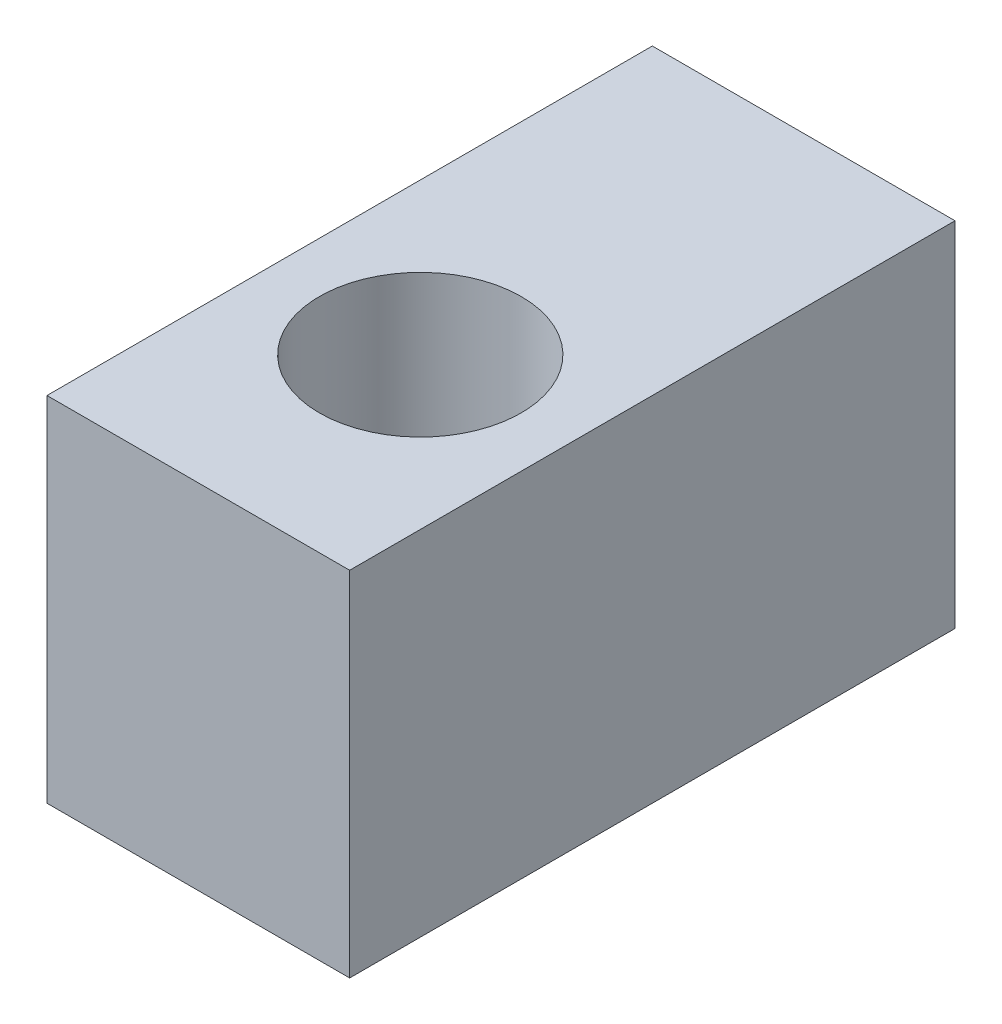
ISO-10303-21;
HEADER;
FILE_DESCRIPTION(('STEP AP214'),'2;1');
FILE_NAME('part.step','',(''),(''),'','','');
FILE_SCHEMA(('AUTOMOTIVE_DESIGN { 1 0 10303 214 1 1 1 1 }'));
ENDSEC;
DATA;
#1=APPLICATION_CONTEXT('core data for automotive mechanical design processes');
#2=APPLICATION_PROTOCOL_DEFINITION('international standard','automotive_design',2000,#1);
#3=PRODUCT_CONTEXT('',#1,'mechanical');
#4=PRODUCT('Part','Part','',(#3));
#5=PRODUCT_RELATED_PRODUCT_CATEGORY('part','',(#4));
#6=PRODUCT_DEFINITION_FORMATION('','',#4);
#7=PRODUCT_DEFINITION_CONTEXT('part definition',#1,'design');
#8=PRODUCT_DEFINITION('design','',#6,#7);
#9=PRODUCT_DEFINITION_SHAPE('','',#8);
#10=(LENGTH_UNIT() NAMED_UNIT(*) SI_UNIT(.MILLI.,.METRE.));
#11=(NAMED_UNIT(*) PLANE_ANGLE_UNIT() SI_UNIT($,.RADIAN.));
#12=(NAMED_UNIT(*) SI_UNIT($,.STERADIAN.) SOLID_ANGLE_UNIT());
#13=UNCERTAINTY_MEASURE_WITH_UNIT(LENGTH_MEASURE(1.E-05),#10,'distance_accuracy_value','');
#14=(GEOMETRIC_REPRESENTATION_CONTEXT(3) GLOBAL_UNCERTAINTY_ASSIGNED_CONTEXT((#13)) GLOBAL_UNIT_ASSIGNED_CONTEXT((#10,
#11,#12)) REPRESENTATION_CONTEXT('',''));
#15=CARTESIAN_POINT('',(0.,0.,0.));
#16=DIRECTION('',(0.,0.,1.));
#17=DIRECTION('',(1.,0.,0.));
#18=AXIS2_PLACEMENT_3D('',#15,#16,#17);
#19=CARTESIAN_POINT('',(0.,0.,60.));
#20=DIRECTION('',(1.,0.,0.));
#21=DIRECTION('',(0.,0.,-1.));
#22=AXIS2_PLACEMENT_3D('',#19,#20,#21);
#23=PLANE('',#22);
#24=DIRECTION('',(0.,-1.,0.));
#25=VECTOR('',#24,1.);
#26=CARTESIAN_POINT('',(0.,0.,0.));
#27=LINE('',#26,#25);
#28=CARTESIAN_POINT('',(0.,0.,0.));
#29=VERTEX_POINT('',#28);
#30=CARTESIAN_POINT('',(0.,-35.,0.));
#31=VERTEX_POINT('',#30);
#32=EDGE_CURVE('E107',#29,#31,#27,.T.);
#33=ORIENTED_EDGE('',*,*,#32,.T.);
#34=DIRECTION('',(0.,0.,-1.));
#35=VECTOR('',#34,1.);
#36=CARTESIAN_POINT('',(0.,-35.,60.));
#37=LINE('',#36,#35);
#38=CARTESIAN_POINT('',(0.,-35.,60.));
#39=VERTEX_POINT('',#38);
#40=EDGE_CURVE('E11',#39,#31,#37,.T.);
#41=ORIENTED_EDGE('',*,*,#40,.F.);
#42=DIRECTION('',(0.,-1.,0.));
#43=VECTOR('',#42,1.);
#44=CARTESIAN_POINT('',(0.,0.,60.));
#45=LINE('',#44,#43);
#46=CARTESIAN_POINT('',(0.,0.,60.));
#47=VERTEX_POINT('',#46);
#48=EDGE_CURVE('E91',#47,#39,#45,.T.);
#49=ORIENTED_EDGE('',*,*,#48,.F.);
#50=DIRECTION('',(0.,0.,-1.));
#51=VECTOR('',#50,1.);
#52=CARTESIAN_POINT('',(0.,0.,60.));
#53=LINE('',#52,#51);
#54=EDGE_CURVE('E103',#47,#29,#53,.T.);
#55=ORIENTED_EDGE('',*,*,#54,.T.);
#56=EDGE_LOOP('',(#33,#41,#49,#55));
#57=FACE_BOUND('',#56,.T.);
#58=ADVANCED_FACE('F39',(#57),#23,.F.);
#59=CARTESIAN_POINT('',(0.,-35.,60.));
#60=DIRECTION('',(0.,1.,0.));
#61=DIRECTION('',(0.,0.,1.));
#62=AXIS2_PLACEMENT_3D('',#59,#60,#61);
#63=PLANE('',#62);
#64=DIRECTION('',(1.,0.,0.));
#65=VECTOR('',#64,1.);
#66=CARTESIAN_POINT('',(0.,-35.,0.));
#67=LINE('',#66,#65);
#68=CARTESIAN_POINT('',(30.,-35.,0.));
#69=VERTEX_POINT('',#68);
#70=EDGE_CURVE('E96',#31,#69,#67,.T.);
#71=ORIENTED_EDGE('',*,*,#70,.T.);
#72=DIRECTION('',(0.,0.,-1.));
#73=VECTOR('',#72,1.);
#74=CARTESIAN_POINT('',(30.,-35.,60.));
#75=LINE('',#74,#73);
#76=CARTESIAN_POINT('',(30.,-35.,60.));
#77=VERTEX_POINT('',#76);
#78=EDGE_CURVE('E48',#77,#69,#75,.T.);
#79=ORIENTED_EDGE('',*,*,#78,.F.);
#80=DIRECTION('',(1.,0.,0.));
#81=VECTOR('',#80,1.);
#82=CARTESIAN_POINT('',(0.,-35.,60.));
#83=LINE('',#82,#81);
#84=EDGE_CURVE('E86',#39,#77,#83,.T.);
#85=ORIENTED_EDGE('',*,*,#84,.F.);
#86=ORIENTED_EDGE('',*,*,#40,.T.);
#87=EDGE_LOOP('',(#71,#79,#85,#86));
#88=FACE_BOUND('',#87,.T.);
#89=ADVANCED_FACE('F95',(#88),#63,.F.);
#90=CARTESIAN_POINT('',(30.,0.,60.));
#91=DIRECTION('',(-1.,0.,0.));
#92=DIRECTION('',(0.,-1.,0.));
#93=AXIS2_PLACEMENT_3D('',#90,#91,#92);
#94=PLANE('',#93);
#95=DIRECTION('',(0.,1.,0.));
#96=VECTOR('',#95,1.);
#97=CARTESIAN_POINT('',(30.,0.,0.));
#98=LINE('',#97,#96);
#99=CARTESIAN_POINT('',(30.,0.,0.));
#100=VERTEX_POINT('',#99);
#101=EDGE_CURVE('E73',#69,#100,#98,.T.);
#102=ORIENTED_EDGE('',*,*,#101,.T.);
#103=DIRECTION('',(0.,0.,-1.));
#104=VECTOR('',#103,1.);
#105=CARTESIAN_POINT('',(30.,0.,60.));
#106=LINE('',#105,#104);
#107=CARTESIAN_POINT('',(30.,0.,60.));
#108=VERTEX_POINT('',#107);
#109=EDGE_CURVE('E98',#108,#100,#106,.T.);
#110=ORIENTED_EDGE('',*,*,#109,.F.);
#111=DIRECTION('',(0.,1.,0.));
#112=VECTOR('',#111,1.);
#113=CARTESIAN_POINT('',(30.,0.,60.));
#114=LINE('',#113,#112);
#115=EDGE_CURVE('E89',#77,#108,#114,.T.);
#116=ORIENTED_EDGE('',*,*,#115,.F.);
#117=ORIENTED_EDGE('',*,*,#78,.T.);
#118=EDGE_LOOP('',(#102,#110,#116,#117));
#119=FACE_BOUND('',#118,.T.);
#120=ADVANCED_FACE('F99',(#119),#94,.F.);
#121=CARTESIAN_POINT('',(0.,0.,60.));
#122=DIRECTION('',(0.,-1.,0.));
#123=DIRECTION('',(0.,0.,-1.));
#124=AXIS2_PLACEMENT_3D('',#121,#122,#123);
#125=PLANE('',#124);
#126=CARTESIAN_POINT('',(15.,0.,38.));
#127=DIRECTION('',(0.,1.,0.));
#128=DIRECTION('',(0.,0.,1.));
#129=AXIS2_PLACEMENT_3D('',#126,#127,#128);
#130=CIRCLE('',#129,10.);
#131=CARTESIAN_POINT('',(15.,0.,48.));
#132=VERTEX_POINT('',#131);
#133=EDGE_CURVE('E128',#132,#132,#130,.T.);
#134=ORIENTED_EDGE('',*,*,#133,.F.);
#135=EDGE_LOOP('',(#134));
#136=FACE_BOUND('',#135,.T.);
#137=DIRECTION('',(-1.,0.,0.));
#138=VECTOR('',#137,1.);
#139=CARTESIAN_POINT('',(0.,0.,0.));
#140=LINE('',#139,#138);
#141=EDGE_CURVE('E79',#100,#29,#140,.T.);
#142=ORIENTED_EDGE('',*,*,#141,.T.);
#143=ORIENTED_EDGE('',*,*,#54,.F.);
#144=DIRECTION('',(-1.,0.,0.));
#145=VECTOR('',#144,1.);
#146=CARTESIAN_POINT('',(0.,0.,60.));
#147=LINE('',#146,#145);
#148=EDGE_CURVE('E56',#108,#47,#147,.T.);
#149=ORIENTED_EDGE('',*,*,#148,.F.);
#150=ORIENTED_EDGE('',*,*,#109,.T.);
#151=EDGE_LOOP('',(#142,#143,#149,#150));
#152=FACE_BOUND('',#151,.T.);
#153=ADVANCED_FACE('F121',(#136,#152),#125,.F.);
#154=CARTESIAN_POINT('',(0.,0.,60.));
#155=DIRECTION('',(0.,0.,1.));
#156=DIRECTION('',(1.,0.,0.));
#157=AXIS2_PLACEMENT_3D('',#154,#155,#156);
#158=PLANE('',#157);
#159=ORIENTED_EDGE('',*,*,#48,.T.);
#160=ORIENTED_EDGE('',*,*,#84,.T.);
#161=ORIENTED_EDGE('',*,*,#115,.T.);
#162=ORIENTED_EDGE('',*,*,#148,.T.);
#163=EDGE_LOOP('',(#159,#160,#161,#162));
#164=FACE_BOUND('',#163,.T.);
#165=ADVANCED_FACE('F87',(#164),#158,.T.);
#166=CARTESIAN_POINT('',(0.,0.,0.));
#167=DIRECTION('',(0.,0.,1.));
#168=DIRECTION('',(1.,0.,0.));
#169=AXIS2_PLACEMENT_3D('',#166,#167,#168);
#170=PLANE('',#169);
#171=ORIENTED_EDGE('',*,*,#32,.F.);
#172=ORIENTED_EDGE('',*,*,#141,.F.);
#173=ORIENTED_EDGE('',*,*,#101,.F.);
#174=ORIENTED_EDGE('',*,*,#70,.F.);
#175=EDGE_LOOP('',(#171,#172,#173,#174));
#176=FACE_BOUND('',#175,.T.);
#177=ADVANCED_FACE('F124',(#176),#170,.F.);
#178=CARTESIAN_POINT('',(15.,-34.,38.));
#179=DIRECTION('',(0.,1.,0.));
#180=DIRECTION('',(0.,0.,1.));
#181=AXIS2_PLACEMENT_3D('',#178,#179,#180);
#182=CYLINDRICAL_SURFACE('',#181,10.);
#183=CARTESIAN_POINT('',(15.,-34.,38.));
#184=DIRECTION('',(0.,1.,0.));
#185=DIRECTION('',(0.,0.,1.));
#186=AXIS2_PLACEMENT_3D('',#183,#184,#185);
#187=CIRCLE('',#186,10.);
#188=CARTESIAN_POINT('',(15.,-34.,48.));
#189=VERTEX_POINT('',#188);
#190=EDGE_CURVE('E111',#189,#189,#187,.T.);
#191=ORIENTED_EDGE('',*,*,#190,.F.);
#192=EDGE_LOOP('',(#191));
#193=FACE_BOUND('',#192,.T.);
#194=ORIENTED_EDGE('',*,*,#133,.T.);
#195=EDGE_LOOP('',(#194));
#196=FACE_BOUND('',#195,.T.);
#197=ADVANCED_FACE('F138',(#193,#196),#182,.F.);
#198=CARTESIAN_POINT('',(15.,-34.,38.));
#199=DIRECTION('',(0.,1.,0.));
#200=DIRECTION('',(0.,0.,1.));
#201=AXIS2_PLACEMENT_3D('',#198,#199,#200);
#202=PLANE('',#201);
#203=ORIENTED_EDGE('',*,*,#190,.T.);
#204=EDGE_LOOP('',(#203));
#205=FACE_BOUND('',#204,.T.);
#206=ADVANCED_FACE('F136',(#205),#202,.T.);
#207=CLOSED_SHELL('',(#58,#89,#120,#153,#165,#177,#197,#206));
#208=MANIFOLD_SOLID_BREP('B2',#207);
#209=ADVANCED_BREP_SHAPE_REPRESENTATION('',(#18,#208),#14);
#210=SHAPE_DEFINITION_REPRESENTATION(#9,#209);
ENDSEC;
END-ISO-10303-21;
